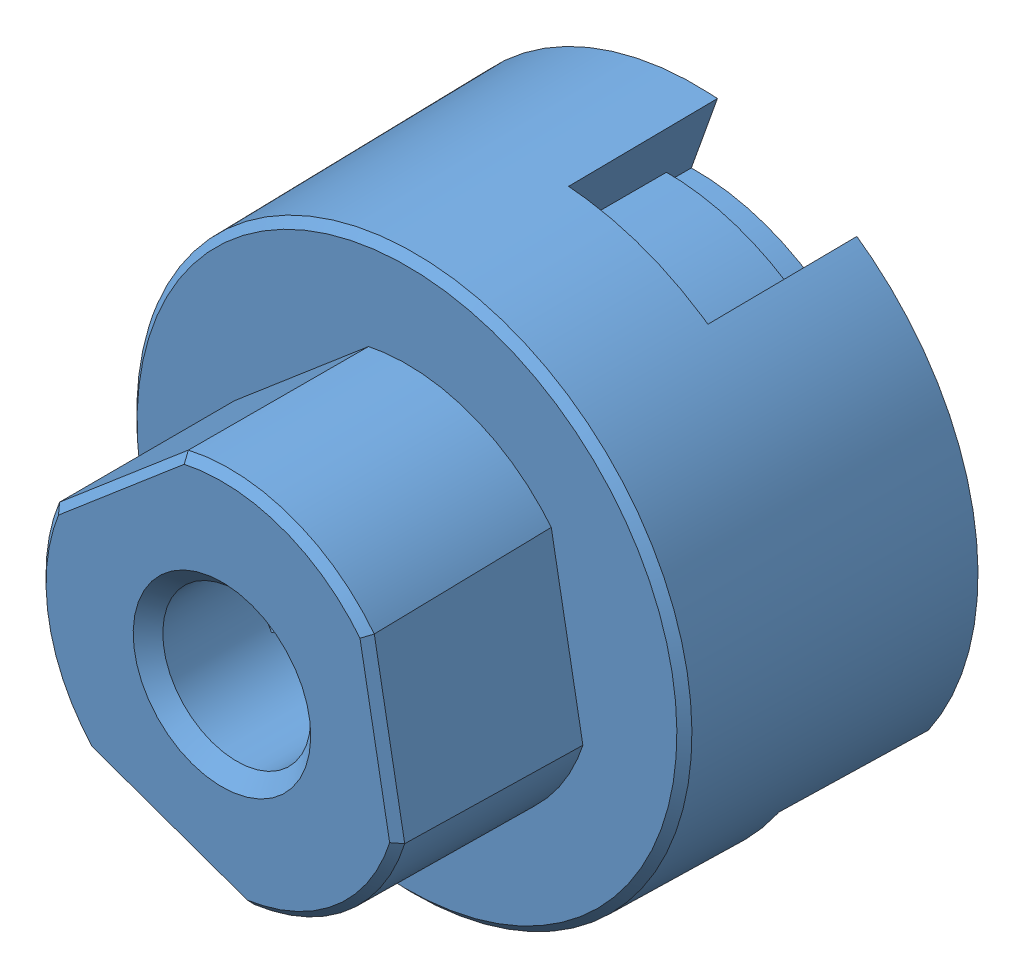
SolidWorks assembly Rotor_moteur_roulis.sldasm, configuration Défaut (file format 10000). Lengths in mm.
Overall size (23.37 23.37 44.35).
2 component instances, 2 part files, 0 mates.
Components (placement in the parent):
- ALD_M840031__P_Portescap_22NT_82_213P_Z20_Rotor-1: ALD_M840031__P_Portescap_22NT_82_213P_Z20_Rotor.sldprt [Default] at (0 0 51.4459) x (-0.949385 -0.314116 0) z (-0.314116 0.949385 0) size (18.5 41.3 18.5)
- ALD_M010053__P_support_aimant-1: ALD_M010053__P_support_aimant.sldprt [Default] at (0 0 48.9) x (-0.941844 0.33605 0) z (-0.33605 -0.941844 0) size (7.64 6.4 7.6)
